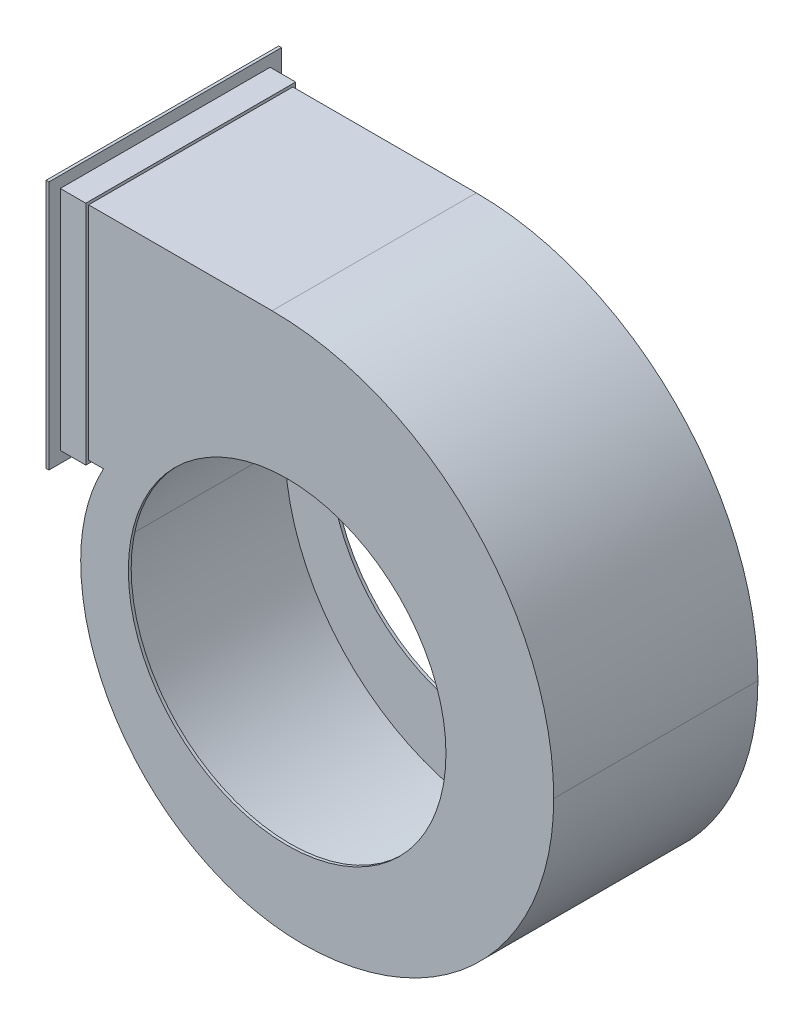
from build123d import *

# Parameters (mm, degrees)
EXTRUDE_1_DEPTH      = 180
SHELL_1_T            = -5
SKETCH_2_R           = 280
CUT_EXTRUDE_2_DEPTH  = 790.959880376
EXTRUDE_3_DEPTH      = 20
EXTRUDE_3_DEPTH_BACK = 30
SKETCH_3_W           = 370
SKETCH_3_H           = 400
SKETCH_3_W_2         = 360
SKETCH_3_H_2         = 390
SKETCH_4_W           = 410
SKETCH_4_H           = 440
SKETCH_4_W_2         = 370
SKETCH_4_H_2         = 400
EXTRUDE_4_DEPTH      = 5


with BuildPart() as part:
    # Sketch 1 → Extrude 1 (new, symmetric)
    with BuildSketch(Plane.XY):
        with BuildLine():
            Line((-26.503638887, 523.007277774), (-380, 523.007277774))
            Line((-380, 523.007277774), (-380, 133.007277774))
            Line((-380, 133.007277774), (-323.909483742, 133.007277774))
            ThreePointArc((-323.909483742, 133.007277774), (-353.813148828, 55.730501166), (-363.985444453, -26.503638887))
            ThreePointArc((-363.985444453, -26.503638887), (-249.613839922, -302.621117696), (26.503638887, -416.992722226))
            ThreePointArc((26.503638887, -416.992722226), (340.102923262, -287.095645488), (470, 26.503638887))
            ThreePointArc((470, 26.503638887), (324.577451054, 377.584728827), (-26.503638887, 523.007277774))
        make_face()
    extrude(amount=EXTRUDE_1_DEPTH, both=True)

    # Shell 1
    shell_1_openings = [part.faces().sort_by_distance(p)[0] for p in [
        (-380, 328.007277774, 0),
    ]]
    offset(amount=SHELL_1_T, openings=shell_1_openings, kind=Kind.INTERSECTION)

    # Sketch 2 → Cut-Extrude 2 (cut, through all)
    with BuildSketch(Plane.XY.offset(180)):
        Circle(SKETCH_2_R)
    extrude(amount=-CUT_EXTRUDE_2_DEPTH, mode=Mode.SUBTRACT)


with BuildPart() as body_2:
    # Sketch 3 → Extrude 3 (new, two sides: drawn at the far end of the back side and taken through both)
    with BuildSketch(Plane.ZY.offset(380).offset(-EXTRUDE_3_DEPTH_BACK)):
        with Locations((0, 328.007277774)):
            Rectangle(SKETCH_3_W, SKETCH_3_H)
        with Locations((0, 328.007277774)):
            Rectangle(SKETCH_3_W_2, SKETCH_3_H_2, mode=Mode.SUBTRACT)
    extrude(amount=EXTRUDE_3_DEPTH + EXTRUDE_3_DEPTH_BACK)

    # Sketch 4 → Extrude 4 (add)
    with BuildSketch(Plane.ZY.offset(400)):
        with Locations((0, 328.007277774)):
            Rectangle(SKETCH_4_W, SKETCH_4_H)
        with Locations((0, 328.007277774)):
            Rectangle(SKETCH_4_W_2, SKETCH_4_H_2, mode=Mode.SUBTRACT)
    extrude(amount=-EXTRUDE_4_DEPTH)


solid = Compound([part.part, body_2.part])
